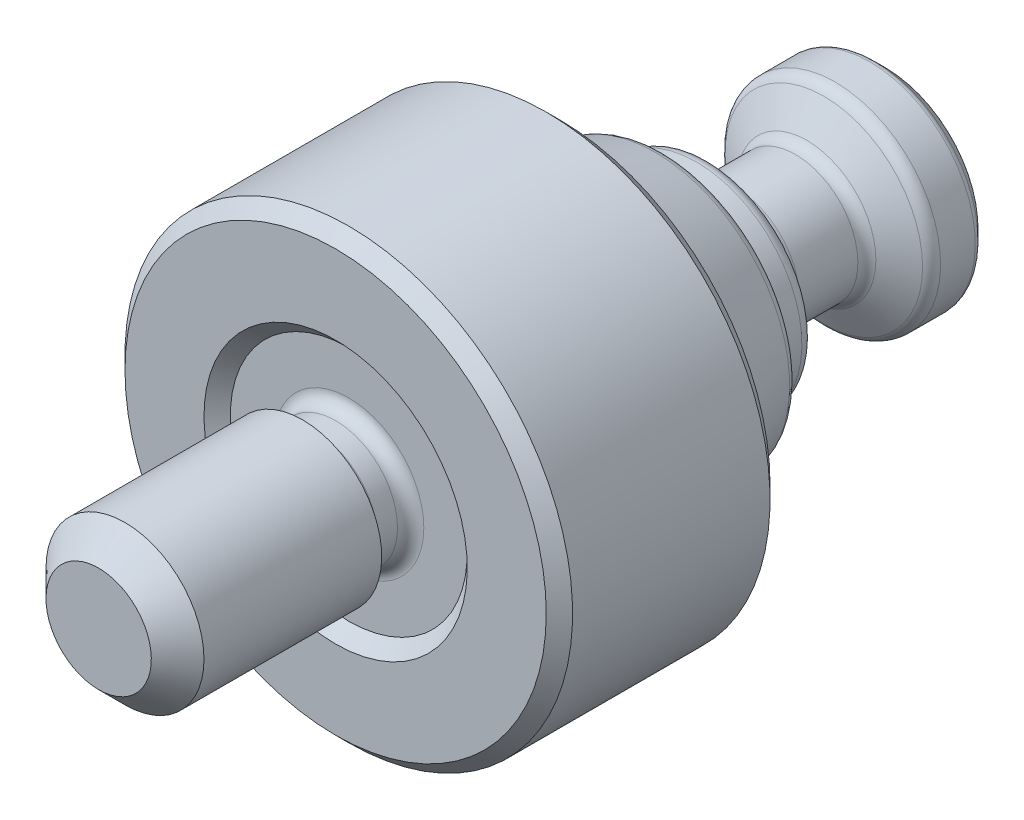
ISO-10303-21;
HEADER;
FILE_DESCRIPTION(('STEP AP214'),'2;1');
FILE_NAME('part.step','',(''),(''),'','','');
FILE_SCHEMA(('AUTOMOTIVE_DESIGN { 1 0 10303 214 1 1 1 1 }'));
ENDSEC;
DATA;
#1=APPLICATION_CONTEXT('core data for automotive mechanical design processes');
#2=APPLICATION_PROTOCOL_DEFINITION('international standard','automotive_design',2000,#1);
#3=PRODUCT_CONTEXT('',#1,'mechanical');
#4=PRODUCT('Part','Part','',(#3));
#5=PRODUCT_RELATED_PRODUCT_CATEGORY('part','',(#4));
#6=PRODUCT_DEFINITION_FORMATION('','',#4);
#7=PRODUCT_DEFINITION_CONTEXT('part definition',#1,'design');
#8=PRODUCT_DEFINITION('design','',#6,#7);
#9=PRODUCT_DEFINITION_SHAPE('','',#8);
#10=(LENGTH_UNIT() NAMED_UNIT(*) SI_UNIT(.MILLI.,.METRE.));
#11=(NAMED_UNIT(*) PLANE_ANGLE_UNIT() SI_UNIT($,.RADIAN.));
#12=(NAMED_UNIT(*) SI_UNIT($,.STERADIAN.) SOLID_ANGLE_UNIT());
#13=UNCERTAINTY_MEASURE_WITH_UNIT(LENGTH_MEASURE(1.E-05),#10,'distance_accuracy_value','');
#14=(GEOMETRIC_REPRESENTATION_CONTEXT(3) GLOBAL_UNCERTAINTY_ASSIGNED_CONTEXT((#13)) GLOBAL_UNIT_ASSIGNED_CONTEXT((#10,
#11,#12)) REPRESENTATION_CONTEXT('',''));
#15=CARTESIAN_POINT('',(0.,0.,0.));
#16=DIRECTION('',(0.,0.,1.));
#17=DIRECTION('',(1.,0.,0.));
#18=AXIS2_PLACEMENT_3D('',#15,#16,#17);
#19=CARTESIAN_POINT('',(0.,0.,16.));
#20=DIRECTION('',(0.,0.,-1.));
#21=DIRECTION('',(0.,1.,0.));
#22=AXIS2_PLACEMENT_3D('',#19,#20,#21);
#23=PLANE('',#22);
#24=CARTESIAN_POINT('',(0.,0.,16.));
#25=DIRECTION('',(0.,0.,1.));
#26=DIRECTION('',(1.,0.,0.));
#27=AXIS2_PLACEMENT_3D('',#24,#25,#26);
#28=CIRCLE('',#27,5.7);
#29=CARTESIAN_POINT('',(5.7,0.,16.));
#30=VERTEX_POINT('',#29);
#31=EDGE_CURVE('E23',#30,#30,#28,.T.);
#32=ORIENTED_EDGE('',*,*,#31,.F.);
#33=EDGE_LOOP('',(#32));
#34=FACE_BOUND('',#33,.T.);
#35=CARTESIAN_POINT('',(0.,0.,16.));
#36=DIRECTION('',(0.,0.,1.));
#37=DIRECTION('',(0.,-1.,0.));
#38=AXIS2_PLACEMENT_3D('',#35,#36,#37);
#39=CIRCLE('',#38,9.);
#40=CARTESIAN_POINT('',(0.,-9.,16.));
#41=VERTEX_POINT('',#40);
#42=EDGE_CURVE('E185',#41,#41,#39,.T.);
#43=ORIENTED_EDGE('',*,*,#42,.T.);
#44=EDGE_LOOP('',(#43));
#45=FACE_BOUND('',#44,.T.);
#46=ADVANCED_FACE('F14',(#34,#45),#23,.F.);
#47=CARTESIAN_POINT('',(0.,0.,35.));
#48=DIRECTION('',(0.,0.,1.));
#49=DIRECTION('',(0.,-1.,0.));
#50=AXIS2_PLACEMENT_3D('',#47,#48,#49);
#51=PLANE('',#50);
#52=CARTESIAN_POINT('',(0.,0.,35.));
#53=DIRECTION('',(0.,0.,1.));
#54=DIRECTION('',(0.,-1.,0.));
#55=AXIS2_PLACEMENT_3D('',#52,#53,#54);
#56=CIRCLE('',#55,4.);
#57=CARTESIAN_POINT('',(0.,-4.,35.));
#58=VERTEX_POINT('',#57);
#59=EDGE_CURVE('E125',#58,#58,#56,.T.);
#60=ORIENTED_EDGE('',*,*,#59,.T.);
#61=EDGE_LOOP('',(#60));
#62=FACE_BOUND('',#61,.T.);
#63=ADVANCED_FACE('F298',(#62),#51,.T.);
#64=CARTESIAN_POINT('',(0.,0.,33.));
#65=DIRECTION('',(0.,0.,-1.));
#66=DIRECTION('',(0.,1.,0.));
#67=AXIS2_PLACEMENT_3D('',#64,#65,#66);
#68=CONICAL_SURFACE('',#67,6.,0.785398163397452);
#69=ORIENTED_EDGE('',*,*,#59,.F.);
#70=EDGE_LOOP('',(#69));
#71=FACE_BOUND('',#70,.T.);
#72=CARTESIAN_POINT('',(0.,0.,33.));
#73=DIRECTION('',(0.,0.,1.));
#74=DIRECTION('',(0.,-1.,0.));
#75=AXIS2_PLACEMENT_3D('',#72,#73,#74);
#76=CIRCLE('',#75,6.);
#77=CARTESIAN_POINT('',(0.,-6.,33.));
#78=VERTEX_POINT('',#77);
#79=EDGE_CURVE('E122',#78,#78,#76,.F.);
#80=ORIENTED_EDGE('',*,*,#79,.F.);
#81=EDGE_LOOP('',(#80));
#82=FACE_BOUND('',#81,.T.);
#83=ADVANCED_FACE('F291',(#71,#82),#68,.T.);
#84=CARTESIAN_POINT('',(0.,0.,0.));
#85=DIRECTION('',(0.,0.,-1.));
#86=DIRECTION('',(0.,1.,0.));
#87=AXIS2_PLACEMENT_3D('',#84,#85,#86);
#88=CYLINDRICAL_SURFACE('',#87,6.);
#89=CARTESIAN_POINT('',(0.,0.,19.5));
#90=DIRECTION('',(0.,0.,-1.));
#91=DIRECTION('',(0.,1.,0.));
#92=AXIS2_PLACEMENT_3D('',#89,#90,#91);
#93=CIRCLE('',#92,6.);
#94=CARTESIAN_POINT('',(0.,6.,19.5));
#95=VERTEX_POINT('',#94);
#96=EDGE_CURVE('E193',#95,#95,#93,.T.);
#97=ORIENTED_EDGE('',*,*,#96,.F.);
#98=EDGE_LOOP('',(#97));
#99=FACE_BOUND('',#98,.T.);
#100=ORIENTED_EDGE('',*,*,#79,.T.);
#101=EDGE_LOOP('',(#100));
#102=FACE_BOUND('',#101,.T.);
#103=ADVANCED_FACE('F281',(#99,#102),#88,.T.);
#104=CARTESIAN_POINT('',(6.,0.,19.5));
#105=DIRECTION('',(0.,0.,1.));
#106=DIRECTION('',(0.,-1.,0.));
#107=AXIS2_PLACEMENT_3D('',#104,#105,#106);
#108=PLANE('',#107);
#109=CARTESIAN_POINT('',(0.,0.,19.5));
#110=DIRECTION('',(0.,0.,1.));
#111=DIRECTION('',(0.,-1.,0.));
#112=AXIS2_PLACEMENT_3D('',#109,#110,#111);
#113=CIRCLE('',#112,5.7);
#114=CARTESIAN_POINT('',(0.,-5.7,19.5));
#115=VERTEX_POINT('',#114);
#116=EDGE_CURVE('E18',#115,#115,#113,.T.);
#117=ORIENTED_EDGE('',*,*,#116,.T.);
#118=EDGE_LOOP('',(#117));
#119=FACE_BOUND('',#118,.T.);
#120=ORIENTED_EDGE('',*,*,#96,.T.);
#121=EDGE_LOOP('',(#120));
#122=FACE_BOUND('',#121,.T.);
#123=ADVANCED_FACE('F279',(#119,#122),#108,.F.);
#124=CARTESIAN_POINT('',(0.,0.,18.5));
#125=DIRECTION('',(0.,0.,1.));
#126=DIRECTION('',(0.,-1.,0.));
#127=AXIS2_PLACEMENT_3D('',#124,#125,#126);
#128=TOROIDAL_SURFACE('',#127,5.7,1.);
#129=ORIENTED_EDGE('',*,*,#116,.F.);
#130=EDGE_LOOP('',(#129));
#131=FACE_BOUND('',#130,.T.);
#132=CARTESIAN_POINT('',(0.,0.,18.5));
#133=DIRECTION('',(0.,0.,1.));
#134=DIRECTION('',(0.,-1.,0.));
#135=AXIS2_PLACEMENT_3D('',#132,#133,#134);
#136=CIRCLE('',#135,4.7);
#137=CARTESIAN_POINT('',(0.,-4.7,18.5));
#138=VERTEX_POINT('',#137);
#139=EDGE_CURVE('E161',#138,#138,#136,.F.);
#140=ORIENTED_EDGE('',*,*,#139,.F.);
#141=EDGE_LOOP('',(#140));
#142=FACE_BOUND('',#141,.T.);
#143=ADVANCED_FACE('F16',(#131,#142),#128,.F.);
#144=CARTESIAN_POINT('',(0.,0.,0.));
#145=DIRECTION('',(0.,0.,-1.));
#146=DIRECTION('',(0.,1.,0.));
#147=AXIS2_PLACEMENT_3D('',#144,#145,#146);
#148=CYLINDRICAL_SURFACE('',#147,4.7);
#149=CARTESIAN_POINT('',(0.,0.,17.));
#150=DIRECTION('',(0.,0.,1.));
#151=DIRECTION('',(0.,-1.,0.));
#152=AXIS2_PLACEMENT_3D('',#149,#150,#151);
#153=CIRCLE('',#152,4.7);
#154=CARTESIAN_POINT('',(0.,-4.7,17.));
#155=VERTEX_POINT('',#154);
#156=EDGE_CURVE('E163',#155,#155,#153,.T.);
#157=ORIENTED_EDGE('',*,*,#156,.T.);
#158=EDGE_LOOP('',(#157));
#159=FACE_BOUND('',#158,.T.);
#160=ORIENTED_EDGE('',*,*,#139,.T.);
#161=EDGE_LOOP('',(#160));
#162=FACE_BOUND('',#161,.T.);
#163=ADVANCED_FACE('F283',(#159,#162),#148,.T.);
#164=CARTESIAN_POINT('',(0.,0.,17.));
#165=DIRECTION('',(0.,0.,1.));
#166=DIRECTION('',(0.,-1.,0.));
#167=AXIS2_PLACEMENT_3D('',#164,#165,#166);
#168=TOROIDAL_SURFACE('',#167,5.7,1.);
#169=ORIENTED_EDGE('',*,*,#156,.F.);
#170=EDGE_LOOP('',(#169));
#171=FACE_BOUND('',#170,.T.);
#172=ORIENTED_EDGE('',*,*,#31,.T.);
#173=EDGE_LOOP('',(#172));
#174=FACE_BOUND('',#173,.T.);
#175=ADVANCED_FACE('F290',(#171,#174),#168,.F.);
#176=CARTESIAN_POINT('',(0.,0.,16.));
#177=DIRECTION('',(0.,0.,-1.));
#178=DIRECTION('',(0.,1.,0.));
#179=AXIS2_PLACEMENT_3D('',#176,#177,#178);
#180=CONICAL_SURFACE('',#179,17.,0.785398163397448);
#181=CARTESIAN_POINT('',(0.,0.,17.));
#182=DIRECTION('',(0.,0.,1.));
#183=DIRECTION('',(0.,-1.,0.));
#184=AXIS2_PLACEMENT_3D('',#181,#182,#183);
#185=CIRCLE('',#184,16.);
#186=CARTESIAN_POINT('',(0.,-16.,17.));
#187=VERTEX_POINT('',#186);
#188=EDGE_CURVE('E177',#187,#187,#185,.T.);
#189=ORIENTED_EDGE('',*,*,#188,.F.);
#190=EDGE_LOOP('',(#189));
#191=FACE_BOUND('',#190,.T.);
#192=CARTESIAN_POINT('',(0.,0.,16.));
#193=DIRECTION('',(0.,0.,1.));
#194=DIRECTION('',(0.,-1.,0.));
#195=AXIS2_PLACEMENT_3D('',#192,#193,#194);
#196=CIRCLE('',#195,17.);
#197=CARTESIAN_POINT('',(0.,-17.,16.));
#198=VERTEX_POINT('',#197);
#199=EDGE_CURVE('E172',#198,#198,#196,.F.);
#200=ORIENTED_EDGE('',*,*,#199,.F.);
#201=EDGE_LOOP('',(#200));
#202=FACE_BOUND('',#201,.T.);
#203=ADVANCED_FACE('F303',(#191,#202),#180,.T.);
#204=CARTESIAN_POINT('',(9.,0.,17.));
#205=DIRECTION('',(0.,0.,1.));
#206=DIRECTION('',(0.,-1.,0.));
#207=AXIS2_PLACEMENT_3D('',#204,#205,#206);
#208=PLANE('',#207);
#209=CARTESIAN_POINT('',(0.,0.,17.));
#210=DIRECTION('',(0.,0.,1.));
#211=DIRECTION('',(0.,-1.,0.));
#212=AXIS2_PLACEMENT_3D('',#209,#210,#211);
#213=CIRCLE('',#212,10.);
#214=CARTESIAN_POINT('',(0.,-10.,17.));
#215=VERTEX_POINT('',#214);
#216=EDGE_CURVE('E188',#215,#215,#213,.F.);
#217=ORIENTED_EDGE('',*,*,#216,.T.);
#218=EDGE_LOOP('',(#217));
#219=FACE_BOUND('',#218,.T.);
#220=ORIENTED_EDGE('',*,*,#188,.T.);
#221=EDGE_LOOP('',(#220));
#222=FACE_BOUND('',#221,.T.);
#223=ADVANCED_FACE('F387',(#219,#222),#208,.T.);
#224=CARTESIAN_POINT('',(0.,0.,17.));
#225=DIRECTION('',(0.,0.,1.));
#226=DIRECTION('',(0.,-1.,0.));
#227=AXIS2_PLACEMENT_3D('',#224,#225,#226);
#228=CONICAL_SURFACE('',#227,10.,0.785398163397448);
#229=ORIENTED_EDGE('',*,*,#42,.F.);
#230=EDGE_LOOP('',(#229));
#231=FACE_BOUND('',#230,.T.);
#232=ORIENTED_EDGE('',*,*,#216,.F.);
#233=EDGE_LOOP('',(#232));
#234=FACE_BOUND('',#233,.T.);
#235=ADVANCED_FACE('F391',(#231,#234),#228,.F.);
#236=CARTESIAN_POINT('',(0.,0.,0.));
#237=DIRECTION('',(0.,0.,-1.));
#238=DIRECTION('',(0.,1.,0.));
#239=AXIS2_PLACEMENT_3D('',#236,#237,#238);
#240=CYLINDRICAL_SURFACE('',#239,17.);
#241=ORIENTED_EDGE('',*,*,#199,.T.);
#242=EDGE_LOOP('',(#241));
#243=FACE_BOUND('',#242,.T.);
#244=CARTESIAN_POINT('',(0.,0.,1.));
#245=DIRECTION('',(0.,0.,-1.));
#246=DIRECTION('',(0.,1.,0.));
#247=AXIS2_PLACEMENT_3D('',#244,#245,#246);
#248=CIRCLE('',#247,17.);
#249=CARTESIAN_POINT('',(0.,17.,1.));
#250=VERTEX_POINT('',#249);
#251=EDGE_CURVE('E168',#250,#250,#248,.F.);
#252=ORIENTED_EDGE('',*,*,#251,.T.);
#253=EDGE_LOOP('',(#252));
#254=FACE_BOUND('',#253,.T.);
#255=ADVANCED_FACE('F381',(#243,#254),#240,.T.);
#256=CARTESIAN_POINT('',(0.,0.,0.));
#257=DIRECTION('',(0.,0.,1.));
#258=DIRECTION('',(0.,-1.,0.));
#259=AXIS2_PLACEMENT_3D('',#256,#257,#258);
#260=CONICAL_SURFACE('',#259,16.,0.78539816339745);
#261=ORIENTED_EDGE('',*,*,#251,.F.);
#262=EDGE_LOOP('',(#261));
#263=FACE_BOUND('',#262,.T.);
#264=CARTESIAN_POINT('',(0.,0.,0.));
#265=DIRECTION('',(0.,0.,-1.));
#266=DIRECTION('',(0.,1.,0.));
#267=AXIS2_PLACEMENT_3D('',#264,#265,#266);
#268=CIRCLE('',#267,16.);
#269=CARTESIAN_POINT('',(0.,16.,0.));
#270=VERTEX_POINT('',#269);
#271=EDGE_CURVE('E182',#270,#270,#268,.T.);
#272=ORIENTED_EDGE('',*,*,#271,.F.);
#273=EDGE_LOOP('',(#272));
#274=FACE_BOUND('',#273,.T.);
#275=ADVANCED_FACE('F373',(#263,#274),#260,.T.);
#276=CARTESIAN_POINT('',(17.,0.,0.));
#277=DIRECTION('',(0.,0.,-1.));
#278=DIRECTION('',(0.,1.,0.));
#279=AXIS2_PLACEMENT_3D('',#276,#277,#278);
#280=PLANE('',#279);
#281=ORIENTED_EDGE('',*,*,#271,.T.);
#282=EDGE_LOOP('',(#281));
#283=FACE_BOUND('',#282,.T.);
#284=CARTESIAN_POINT('',(0.,0.,0.));
#285=DIRECTION('',(0.,0.,-1.));
#286=DIRECTION('',(-1.,0.,0.));
#287=AXIS2_PLACEMENT_3D('',#284,#285,#286);
#288=CIRCLE('',#287,11.8);
#289=CARTESIAN_POINT('',(-11.8,0.,0.));
#290=VERTEX_POINT('',#289);
#291=EDGE_CURVE('E9',#290,#290,#288,.T.);
#292=ORIENTED_EDGE('',*,*,#291,.F.);
#293=EDGE_LOOP('',(#292));
#294=FACE_BOUND('',#293,.T.);
#295=ADVANCED_FACE('F362',(#283,#294),#280,.T.);
#296=CARTESIAN_POINT('',(2.88675134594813,0.,-21.5));
#297=DIRECTION('',(0.,0.,-1.));
#298=DIRECTION('',(0.,1.,0.));
#299=AXIS2_PLACEMENT_3D('',#296,#297,#298);
#300=PLANE('',#299);
#301=DIRECTION('',(-0.5,0.866025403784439,0.));
#302=VECTOR('',#301,1.);
#303=CARTESIAN_POINT('',(-1.44337567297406,-2.5,-21.5));
#304=LINE('',#303,#302);
#305=CARTESIAN_POINT('',(-1.44337567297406,-2.5,-21.5));
#306=VERTEX_POINT('',#305);
#307=CARTESIAN_POINT('',(-2.88675134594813,0.,-21.5));
#308=VERTEX_POINT('',#307);
#309=EDGE_CURVE('E700',#306,#308,#304,.T.);
#310=ORIENTED_EDGE('',*,*,#309,.T.);
#311=DIRECTION('',(0.5,0.866025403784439,0.));
#312=VECTOR('',#311,1.);
#313=CARTESIAN_POINT('',(-2.88675134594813,0.,-21.5));
#314=LINE('',#313,#312);
#315=CARTESIAN_POINT('',(-1.44337567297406,2.5,-21.5));
#316=VERTEX_POINT('',#315);
#317=EDGE_CURVE('E701',#308,#316,#314,.T.);
#318=ORIENTED_EDGE('',*,*,#317,.T.);
#319=DIRECTION('',(1.,0.,0.));
#320=VECTOR('',#319,1.);
#321=CARTESIAN_POINT('',(-1.44337567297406,2.5,-21.5));
#322=LINE('',#321,#320);
#323=CARTESIAN_POINT('',(1.44337567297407,2.5,-21.5));
#324=VERTEX_POINT('',#323);
#325=EDGE_CURVE('E39',#316,#324,#322,.T.);
#326=ORIENTED_EDGE('',*,*,#325,.T.);
#327=DIRECTION('',(0.5,-0.866025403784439,0.));
#328=VECTOR('',#327,1.);
#329=CARTESIAN_POINT('',(1.44337567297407,2.5,-21.5));
#330=LINE('',#329,#328);
#331=CARTESIAN_POINT('',(2.88675134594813,0.,-21.5));
#332=VERTEX_POINT('',#331);
#333=EDGE_CURVE('E87',#324,#332,#330,.T.);
#334=ORIENTED_EDGE('',*,*,#333,.T.);
#335=DIRECTION('',(-0.5,-0.866025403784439,0.));
#336=VECTOR('',#335,1.);
#337=CARTESIAN_POINT('',(2.88675134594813,0.,-21.5));
#338=LINE('',#337,#336);
#339=CARTESIAN_POINT('',(1.44337567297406,-2.5,-21.5));
#340=VERTEX_POINT('',#339);
#341=EDGE_CURVE('E704',#332,#340,#338,.T.);
#342=ORIENTED_EDGE('',*,*,#341,.T.);
#343=DIRECTION('',(-1.,0.,0.));
#344=VECTOR('',#343,1.);
#345=CARTESIAN_POINT('',(1.44337567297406,-2.5,-21.5));
#346=LINE('',#345,#344);
#347=EDGE_CURVE('E702',#340,#306,#346,.T.);
#348=ORIENTED_EDGE('',*,*,#347,.T.);
#349=EDGE_LOOP('',(#310,#318,#326,#334,#342,#348));
#350=FACE_BOUND('',#349,.T.);
#351=ADVANCED_FACE('F261',(#350),#300,.T.);
#352=CARTESIAN_POINT('',(1.44337567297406,-2.5,-21.5));
#353=DIRECTION('',(0.,-1.,0.));
#354=DIRECTION('',(1.,0.,0.));
#355=AXIS2_PLACEMENT_3D('',#352,#353,#354);
#356=PLANE('',#355);
#357=CARTESIAN_POINT('',(-3.77372348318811,-2.5,-25.7659690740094));
#358=CARTESIAN_POINT('',(-3.66532713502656,-2.5,-25.7138116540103));
#359=CARTESIAN_POINT('',(-3.5566704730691,-2.5,-25.6621853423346));
#360=CARTESIAN_POINT('',(-3.33869759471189,-2.5,-25.5602960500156));
#361=CARTESIAN_POINT('',(-3.22938126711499,-2.5,-25.5100333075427));
#362=CARTESIAN_POINT('',(-3.00933576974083,-2.5,-25.4108968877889));
#363=CARTESIAN_POINT('',(-2.89860206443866,-2.5,-25.3620332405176));
#364=CARTESIAN_POINT('',(-2.67621651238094,-2.5,-25.2664499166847));
#365=CARTESIAN_POINT('',(-2.56456471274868,-2.5,-25.2197301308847));
#366=CARTESIAN_POINT('',(-2.33704252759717,-2.5,-25.1277417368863));
#367=CARTESIAN_POINT('',(-2.22114109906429,-2.5,-25.082549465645));
#368=CARTESIAN_POINT('',(-1.98794483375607,-2.5,-24.9958424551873));
#369=CARTESIAN_POINT('',(-1.87064983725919,-2.5,-24.9543281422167));
#370=CARTESIAN_POINT('',(-1.63473483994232,-2.5,-24.8761429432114));
#371=CARTESIAN_POINT('',(-1.51611844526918,-2.5,-24.8394612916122));
#372=CARTESIAN_POINT('',(-1.27718906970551,-2.5,-24.7721855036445));
#373=CARTESIAN_POINT('',(-1.15687666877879,-2.5,-24.7415893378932));
#374=CARTESIAN_POINT('',(-0.91510414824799,-2.5,-24.6881678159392));
#375=CARTESIAN_POINT('',(-0.793652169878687,-2.5,-24.6653063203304));
#376=CARTESIAN_POINT('',(-0.549353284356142,-2.5,-24.628724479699));
#377=CARTESIAN_POINT('',(-0.426506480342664,-2.5,-24.6150034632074));
#378=CARTESIAN_POINT('',(-0.181589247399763,-2.5,-24.5979769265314));
#379=CARTESIAN_POINT('',(-0.0595277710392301,-2.5,-24.5945457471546));
#380=CARTESIAN_POINT('',(0.184453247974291,-2.5,-24.5980647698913));
#381=CARTESIAN_POINT('',(0.306372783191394,-2.5,-24.6050154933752));
#382=CARTESIAN_POINT('',(0.516525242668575,-2.5,-24.6254710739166));
#383=CARTESIAN_POINT('',(0.604990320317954,-2.5,-24.636707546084));
#384=CARTESIAN_POINT('',(0.78120116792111,-2.5,-24.6638879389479));
#385=CARTESIAN_POINT('',(0.868946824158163,-2.5,-24.6798325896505));
#386=CARTESIAN_POINT('',(1.13101461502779,-2.5,-24.73388535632));
#387=CARTESIAN_POINT('',(1.30405772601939,-2.5,-24.7782002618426));
#388=CARTESIAN_POINT('',(1.65032858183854,-2.5,-24.879785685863));
#389=CARTESIAN_POINT('',(1.82347546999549,-2.5,-24.9373214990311));
#390=CARTESIAN_POINT('',(2.08081862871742,-2.5,-25.0300094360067));
#391=CARTESIAN_POINT('',(2.16619199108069,-2.5,-25.0619646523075));
#392=CARTESIAN_POINT('',(2.33624768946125,-2.5,-25.1276627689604));
#393=CARTESIAN_POINT('',(2.42093003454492,-2.5,-25.1614056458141));
#394=CARTESIAN_POINT('',(2.62603474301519,-2.5,-25.2452265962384));
#395=CARTESIAN_POINT('',(2.7461393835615,-2.5,-25.2960801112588));
#396=CARTESIAN_POINT('',(2.9853252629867,-2.5,-25.4001455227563));
#397=CARTESIAN_POINT('',(3.10440644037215,-2.5,-25.4533575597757));
#398=CARTESIAN_POINT('',(3.46043992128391,-2.5,-25.6157641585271));
#399=CARTESIAN_POINT('',(3.69613537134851,-2.5,-25.7277095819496));
#400=CARTESIAN_POINT('',(4.16548797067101,-2.5,-25.9563787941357));
#401=CARTESIAN_POINT('',(4.39914263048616,-2.5,-26.0731076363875));
#402=CARTESIAN_POINT('',(4.86481739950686,-2.5,-26.3097054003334));
#403=CARTESIAN_POINT('',(5.09683770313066,-2.5,-26.4295739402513));
#404=CARTESIAN_POINT('',(5.5396497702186,-2.5,-26.6610256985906));
#405=CARTESIAN_POINT('',(5.75053751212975,-2.5,-26.7724259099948));
#406=CARTESIAN_POINT('',(6.17158854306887,-2.5,-26.9966038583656));
#407=CARTESIAN_POINT('',(6.38175180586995,-2.5,-27.109381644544));
#408=CARTESIAN_POINT('',(6.80101584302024,-2.5,-27.3357110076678));
#409=CARTESIAN_POINT('',(7.01011795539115,-2.5,-27.4492601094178));
#410=CARTESIAN_POINT('',(7.42786313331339,-2.5,-27.6771738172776));
#411=CARTESIAN_POINT('',(7.63650622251,-2.5,-27.7915383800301));
#412=CARTESIAN_POINT('',(7.84498187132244,-2.5,-27.9062054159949));
#413=B_SPLINE_CURVE_WITH_KNOTS('',3,(#357,#358,#359,#360,#361,#362,#363,#364,#365,#366,#367,
#368,#369,#370,#371,#372,#373,#374,#375,#376,#377,#378,#379,#380,#381,#382,#383,#384,#385,#386,
#387,#388,#389,#390,#391,#392,#393,#394,#395,#396,#397,#398,#399,#400,#401,#402,#403,#404,#405,
#406,#407,#408,#409,#410,#411,#412),.UNSPECIFIED.,.F.,.F.,(4,2,2,2,2,2,2,2,2,2,2,2,2,2,2,2,2,2,
2,2,2,2,2,2,2,2,2,4),(0.,0.360880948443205,0.721824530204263,1.08491311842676,1.44798318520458,
1.8211364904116,2.19433298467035,2.56668353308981,2.93890970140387,3.30937185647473,
3.6798067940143,4.04569918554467,4.41160995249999,4.67900678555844,4.94644510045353,
5.48165172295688,6.02871656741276,6.30217432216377,6.57562848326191,6.96687524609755,
7.35814535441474,8.14083774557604,8.92437948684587,9.70782639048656,10.4233292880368,
11.1388578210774,11.8526862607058,12.5664770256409),.UNSPECIFIED.);
#414=CARTESIAN_POINT('',(-1.44337567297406,-2.5,-24.8191458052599));
#415=VERTEX_POINT('',#414);
#416=CARTESIAN_POINT('',(1.44337567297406,-2.5,-24.8191458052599));
#417=VERTEX_POINT('',#416);
#418=EDGE_CURVE('E246',#415,#417,#413,.T.);
#419=ORIENTED_EDGE('',*,*,#418,.F.);
#420=DIRECTION('',(0.,0.,-1.));
#421=VECTOR('',#420,1.);
#422=CARTESIAN_POINT('',(-1.44337567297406,-2.5,-21.5));
#423=LINE('',#422,#421);
#424=EDGE_CURVE('E100',#306,#415,#423,.T.);
#425=ORIENTED_EDGE('',*,*,#424,.F.);
#426=ORIENTED_EDGE('',*,*,#347,.F.);
#427=DIRECTION('',(0.,0.,-1.));
#428=VECTOR('',#427,1.);
#429=CARTESIAN_POINT('',(1.44337567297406,-2.5,-21.5));
#430=LINE('',#429,#428);
#431=EDGE_CURVE('E103',#340,#417,#430,.T.);
#432=ORIENTED_EDGE('',*,*,#431,.T.);
#433=EDGE_LOOP('',(#419,#425,#426,#432));
#434=FACE_BOUND('',#433,.T.);
#435=ADVANCED_FACE('F257',(#434),#356,.F.);
#436=CARTESIAN_POINT('',(-1.44337567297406,-2.5,-21.5));
#437=DIRECTION('',(-0.866025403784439,-0.5,0.));
#438=DIRECTION('',(0.5,-0.866025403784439,0.));
#439=AXIS2_PLACEMENT_3D('',#436,#437,#438);
#440=PLANE('',#439);
#441=CARTESIAN_POINT('',(-2.88686681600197,0.00019999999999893,-24.8192124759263));
#442=CARTESIAN_POINT('',(-2.82343724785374,-0.109663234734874,-24.7825764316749));
#443=CARTESIAN_POINT('',(-2.75946016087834,-0.220474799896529,-24.7492570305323));
#444=CARTESIAN_POINT('',(-2.63039810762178,-0.444016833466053,-24.6910970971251));
#445=CARTESIAN_POINT('',(-2.56531084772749,-0.556751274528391,-24.666277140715));
#446=CARTESIAN_POINT('',(-2.43594298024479,-0.780822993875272,-24.6276404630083));
#447=CARTESIAN_POINT('',(-2.37168227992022,-0.89212579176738,-24.6135666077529));
#448=CARTESIAN_POINT('',(-2.24285844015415,-1.11525522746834,-24.59676396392));
#449=CARTESIAN_POINT('',(-2.17829576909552,-1.22708105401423,-24.5940212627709));
#450=CARTESIAN_POINT('',(-2.05765212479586,-1.43604197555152,-24.5997205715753));
#451=CARTESIAN_POINT('',(-2.0015531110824,-1.53320831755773,-24.6067632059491));
#452=CARTESIAN_POINT('',(-1.88972057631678,-1.726907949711,-24.6290862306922));
#453=CARTESIAN_POINT('',(-1.8339874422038,-1.82344056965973,-24.6443742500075));
#454=CARTESIAN_POINT('',(-1.7219242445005,-2.01753972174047,-24.6825939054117));
#455=CARTESIAN_POINT('',(-1.66560836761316,-2.11508168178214,-24.7056875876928));
#456=CARTESIAN_POINT('',(-1.55381665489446,-2.30871060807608,-24.7581014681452));
#457=CARTESIAN_POINT('',(-1.49833938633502,-2.40480005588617,-24.7874093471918));
#458=CARTESIAN_POINT('',(-1.44326020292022,-2.5002,-24.8192124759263));
#459=B_SPLINE_CURVE_WITH_KNOTS('',3,(#441,#442,#443,#444,#445,#446,#447,#448,#449,#450,#451,
#452,#453,#454,#455,#456,#457,#458),.UNSPECIFIED.,.F.,.F.,(4,2,2,2,2,2,2,2,4),(0.,
0.396285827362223,0.793524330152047,1.18093086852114,1.56786160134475,1.90479741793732,
2.24204551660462,2.58677531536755,2.93082800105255),.UNSPECIFIED.);
#460=CARTESIAN_POINT('',(-2.88675134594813,0.,-24.8191458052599));
#461=VERTEX_POINT('',#460);
#462=EDGE_CURVE('E239',#461,#415,#459,.T.);
#463=ORIENTED_EDGE('',*,*,#462,.F.);
#464=DIRECTION('',(0.,0.,-1.));
#465=VECTOR('',#464,1.);
#466=CARTESIAN_POINT('',(-2.88675134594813,0.,-21.5));
#467=LINE('',#466,#465);
#468=EDGE_CURVE('E93',#308,#461,#467,.T.);
#469=ORIENTED_EDGE('',*,*,#468,.F.);
#470=ORIENTED_EDGE('',*,*,#309,.F.);
#471=ORIENTED_EDGE('',*,*,#424,.T.);
#472=EDGE_LOOP('',(#463,#469,#470,#471));
#473=FACE_BOUND('',#472,.T.);
#474=ADVANCED_FACE('F260',(#473),#440,.F.);
#475=CARTESIAN_POINT('',(-2.88675134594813,0.,-21.5));
#476=DIRECTION('',(-0.866025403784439,0.5,0.));
#477=DIRECTION('',(-0.5,-0.866025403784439,0.));
#478=AXIS2_PLACEMENT_3D('',#475,#476,#477);
#479=PLANE('',#478);
#480=CARTESIAN_POINT('',(-1.44326020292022,2.5002,-24.8192124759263));
#481=CARTESIAN_POINT('',(-1.50668977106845,2.39033676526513,-24.7825764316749));
#482=CARTESIAN_POINT('',(-1.57066685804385,2.27952520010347,-24.7492570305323));
#483=CARTESIAN_POINT('',(-1.69972891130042,2.05598316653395,-24.6910970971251));
#484=CARTESIAN_POINT('',(-1.7648161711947,1.94324872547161,-24.666277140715));
#485=CARTESIAN_POINT('',(-1.8941840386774,1.71917700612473,-24.6276404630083));
#486=CARTESIAN_POINT('',(-1.95844473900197,1.60787420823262,-24.6135666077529));
#487=CARTESIAN_POINT('',(-2.08726857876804,1.38474477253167,-24.59676396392));
#488=CARTESIAN_POINT('',(-2.15183124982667,1.27291894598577,-24.5940212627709));
#489=CARTESIAN_POINT('',(-2.27247489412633,1.06395802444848,-24.5997205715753));
#490=CARTESIAN_POINT('',(-2.32857390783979,0.966791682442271,-24.6067632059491));
#491=CARTESIAN_POINT('',(-2.44040644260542,0.773092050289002,-24.6290862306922));
#492=CARTESIAN_POINT('',(-2.49613957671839,0.676559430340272,-24.6443742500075));
#493=CARTESIAN_POINT('',(-2.60820277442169,0.482460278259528,-24.6825939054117));
#494=CARTESIAN_POINT('',(-2.66451865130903,0.384918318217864,-24.7056875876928));
#495=CARTESIAN_POINT('',(-2.77631036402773,0.191289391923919,-24.7581014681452));
#496=CARTESIAN_POINT('',(-2.83178763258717,0.0951999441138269,-24.7874093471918));
#497=CARTESIAN_POINT('',(-2.88686681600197,-0.000200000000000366,-24.8192124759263));
#498=B_SPLINE_CURVE_WITH_KNOTS('',3,(#480,#481,#482,#483,#484,#485,#486,#487,#488,#489,#490,
#491,#492,#493,#494,#495,#496,#497),.UNSPECIFIED.,.F.,.F.,(4,2,2,2,2,2,2,2,4),(0.,
0.396285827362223,0.793524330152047,1.18093086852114,1.56786160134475,1.90479741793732,
2.24204551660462,2.58677531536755,2.93082800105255),.UNSPECIFIED.);
#499=CARTESIAN_POINT('',(-1.44337567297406,2.5,-24.8191458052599));
#500=VERTEX_POINT('',#499);
#501=EDGE_CURVE('E84',#500,#461,#498,.T.);
#502=ORIENTED_EDGE('',*,*,#501,.F.);
#503=DIRECTION('',(0.,0.,-1.));
#504=VECTOR('',#503,1.);
#505=CARTESIAN_POINT('',(-1.44337567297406,2.5,-21.5));
#506=LINE('',#505,#504);
#507=EDGE_CURVE('E83',#316,#500,#506,.T.);
#508=ORIENTED_EDGE('',*,*,#507,.F.);
#509=ORIENTED_EDGE('',*,*,#317,.F.);
#510=ORIENTED_EDGE('',*,*,#468,.T.);
#511=EDGE_LOOP('',(#502,#508,#509,#510));
#512=FACE_BOUND('',#511,.T.);
#513=ADVANCED_FACE('F571',(#512),#479,.F.);
#514=CARTESIAN_POINT('',(-1.44337567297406,2.5,-21.5));
#515=DIRECTION('',(0.,1.,0.));
#516=DIRECTION('',(-1.,0.,0.));
#517=AXIS2_PLACEMENT_3D('',#514,#515,#516);
#518=PLANE('',#517);
#519=CARTESIAN_POINT('',(-3.77372348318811,2.5,-25.7659690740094));
#520=CARTESIAN_POINT('',(-3.66532713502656,2.5,-25.7138116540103));
#521=CARTESIAN_POINT('',(-3.5566704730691,2.5,-25.6621853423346));
#522=CARTESIAN_POINT('',(-3.33869759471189,2.5,-25.5602960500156));
#523=CARTESIAN_POINT('',(-3.22938126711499,2.5,-25.5100333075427));
#524=CARTESIAN_POINT('',(-3.00933576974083,2.5,-25.4108968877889));
#525=CARTESIAN_POINT('',(-2.89860206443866,2.5,-25.3620332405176));
#526=CARTESIAN_POINT('',(-2.67621651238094,2.5,-25.2664499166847));
#527=CARTESIAN_POINT('',(-2.56456471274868,2.5,-25.2197301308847));
#528=CARTESIAN_POINT('',(-2.33704252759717,2.5,-25.1277417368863));
#529=CARTESIAN_POINT('',(-2.22114109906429,2.5,-25.082549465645));
#530=CARTESIAN_POINT('',(-1.98794483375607,2.5,-24.9958424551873));
#531=CARTESIAN_POINT('',(-1.87064983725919,2.5,-24.9543281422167));
#532=CARTESIAN_POINT('',(-1.63473483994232,2.5,-24.8761429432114));
#533=CARTESIAN_POINT('',(-1.51611844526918,2.5,-24.8394612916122));
#534=CARTESIAN_POINT('',(-1.27718906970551,2.5,-24.7721855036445));
#535=CARTESIAN_POINT('',(-1.15687666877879,2.5,-24.7415893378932));
#536=CARTESIAN_POINT('',(-0.915104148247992,2.5,-24.6881678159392));
#537=CARTESIAN_POINT('',(-0.793652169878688,2.5,-24.6653063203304));
#538=CARTESIAN_POINT('',(-0.549353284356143,2.5,-24.628724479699));
#539=CARTESIAN_POINT('',(-0.426506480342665,2.5,-24.6150034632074));
#540=CARTESIAN_POINT('',(-0.181589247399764,2.5,-24.5979769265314));
#541=CARTESIAN_POINT('',(-0.0595277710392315,2.5,-24.5945457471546));
#542=CARTESIAN_POINT('',(0.18445324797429,2.5,-24.5980647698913));
#543=CARTESIAN_POINT('',(0.306372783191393,2.5,-24.6050154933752));
#544=CARTESIAN_POINT('',(0.516525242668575,2.5,-24.6254710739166));
#545=CARTESIAN_POINT('',(0.604990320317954,2.5,-24.636707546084));
#546=CARTESIAN_POINT('',(0.781201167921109,2.5,-24.6638879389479));
#547=CARTESIAN_POINT('',(0.868946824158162,2.5,-24.6798325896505));
#548=CARTESIAN_POINT('',(1.13101461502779,2.5,-24.73388535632));
#549=CARTESIAN_POINT('',(1.30405772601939,2.5,-24.7782002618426));
#550=CARTESIAN_POINT('',(1.65032858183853,2.5,-24.879785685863));
#551=CARTESIAN_POINT('',(1.82347546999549,2.5,-24.9373214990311));
#552=CARTESIAN_POINT('',(2.08081862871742,2.5,-25.0300094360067));
#553=CARTESIAN_POINT('',(2.16619199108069,2.5,-25.0619646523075));
#554=CARTESIAN_POINT('',(2.33624768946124,2.5,-25.1276627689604));
#555=CARTESIAN_POINT('',(2.42093003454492,2.5,-25.1614056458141));
#556=CARTESIAN_POINT('',(2.62603474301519,2.5,-25.2452265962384));
#557=CARTESIAN_POINT('',(2.74613938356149,2.5,-25.2960801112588));
#558=CARTESIAN_POINT('',(2.9853252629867,2.5,-25.4001455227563));
#559=CARTESIAN_POINT('',(3.10440644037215,2.5,-25.4533575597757));
#560=CARTESIAN_POINT('',(3.46043992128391,2.5,-25.6157641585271));
#561=CARTESIAN_POINT('',(3.69613537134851,2.5,-25.7277095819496));
#562=CARTESIAN_POINT('',(4.16548797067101,2.5,-25.9563787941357));
#563=CARTESIAN_POINT('',(4.39914263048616,2.5,-26.0731076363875));
#564=CARTESIAN_POINT('',(4.86481739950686,2.5,-26.3097054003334));
#565=CARTESIAN_POINT('',(5.09683770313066,2.5,-26.4295739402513));
#566=CARTESIAN_POINT('',(5.5396497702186,2.5,-26.6610256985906));
#567=CARTESIAN_POINT('',(5.75053751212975,2.5,-26.7724259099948));
#568=CARTESIAN_POINT('',(6.17158854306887,2.5,-26.9966038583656));
#569=CARTESIAN_POINT('',(6.38175180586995,2.5,-27.109381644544));
#570=CARTESIAN_POINT('',(6.80101584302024,2.5,-27.3357110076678));
#571=CARTESIAN_POINT('',(7.01011795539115,2.5,-27.4492601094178));
#572=CARTESIAN_POINT('',(7.42786313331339,2.5,-27.6771738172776));
#573=CARTESIAN_POINT('',(7.63650622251,2.5,-27.7915383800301));
#574=CARTESIAN_POINT('',(7.84498187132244,2.5,-27.9062054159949));
#575=B_SPLINE_CURVE_WITH_KNOTS('',3,(#519,#520,#521,#522,#523,#524,#525,#526,#527,#528,#529,
#530,#531,#532,#533,#534,#535,#536,#537,#538,#539,#540,#541,#542,#543,#544,#545,#546,#547,#548,
#549,#550,#551,#552,#553,#554,#555,#556,#557,#558,#559,#560,#561,#562,#563,#564,#565,#566,#567,
#568,#569,#570,#571,#572,#573,#574),.UNSPECIFIED.,.F.,.F.,(4,2,2,2,2,2,2,2,2,2,2,2,2,2,2,2,2,2,
2,2,2,2,2,2,2,2,2,4),(0.,0.360880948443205,0.721824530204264,1.08491311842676,1.44798318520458,
1.8211364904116,2.19433298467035,2.56668353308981,2.93890970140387,3.30937185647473,
3.6798067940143,4.04569918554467,4.41160995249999,4.67900678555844,4.94644510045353,
5.48165172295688,6.02871656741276,6.30217432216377,6.57562848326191,6.96687524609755,
7.35814535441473,8.14083774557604,8.92437948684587,9.70782639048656,10.4233292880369,
11.1388578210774,11.8526862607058,12.5664770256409),.UNSPECIFIED.);
#576=CARTESIAN_POINT('',(1.44337567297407,2.5,-24.8191458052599));
#577=VERTEX_POINT('',#576);
#578=EDGE_CURVE('E69',#577,#500,#575,.F.);
#579=ORIENTED_EDGE('',*,*,#578,.F.);
#580=DIRECTION('',(0.,0.,-1.));
#581=VECTOR('',#580,1.);
#582=CARTESIAN_POINT('',(1.44337567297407,2.5,-21.5));
#583=LINE('',#582,#581);
#584=EDGE_CURVE('E80',#324,#577,#583,.T.);
#585=ORIENTED_EDGE('',*,*,#584,.F.);
#586=ORIENTED_EDGE('',*,*,#325,.F.);
#587=ORIENTED_EDGE('',*,*,#507,.T.);
#588=EDGE_LOOP('',(#579,#585,#586,#587));
#589=FACE_BOUND('',#588,.T.);
#590=ADVANCED_FACE('F79',(#589),#518,.F.);
#591=CARTESIAN_POINT('',(1.44337567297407,2.5,-21.5));
#592=DIRECTION('',(0.866025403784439,0.5,0.));
#593=DIRECTION('',(-0.5,0.866025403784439,0.));
#594=AXIS2_PLACEMENT_3D('',#591,#592,#593);
#595=PLANE('',#594);
#596=CARTESIAN_POINT('',(2.88686681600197,-0.000199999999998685,-24.8192124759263));
#597=CARTESIAN_POINT('',(2.82343724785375,0.109663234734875,-24.7825764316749));
#598=CARTESIAN_POINT('',(2.75946016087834,0.220474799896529,-24.7492570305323));
#599=CARTESIAN_POINT('',(2.63039810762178,0.444016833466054,-24.6910970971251));
#600=CARTESIAN_POINT('',(2.5653108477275,0.556751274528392,-24.666277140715));
#601=CARTESIAN_POINT('',(2.43594298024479,0.780822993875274,-24.6276404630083));
#602=CARTESIAN_POINT('',(2.37168227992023,0.892125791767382,-24.6135666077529));
#603=CARTESIAN_POINT('',(2.24285844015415,1.11525522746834,-24.59676396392));
#604=CARTESIAN_POINT('',(2.17829576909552,1.22708105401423,-24.5940212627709));
#605=CARTESIAN_POINT('',(2.05765212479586,1.43604197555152,-24.5997205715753));
#606=CARTESIAN_POINT('',(2.0015531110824,1.53320831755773,-24.6067632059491));
#607=CARTESIAN_POINT('',(1.88972057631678,1.726907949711,-24.6290862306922));
#608=CARTESIAN_POINT('',(1.8339874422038,1.82344056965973,-24.6443742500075));
#609=CARTESIAN_POINT('',(1.72192424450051,2.01753972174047,-24.6825939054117));
#610=CARTESIAN_POINT('',(1.66560836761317,2.11508168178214,-24.7056875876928));
#611=CARTESIAN_POINT('',(1.55381665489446,2.30871060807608,-24.7581014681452));
#612=CARTESIAN_POINT('',(1.49833938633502,2.40480005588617,-24.7874093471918));
#613=CARTESIAN_POINT('',(1.44326020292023,2.5002,-24.8192124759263));
#614=B_SPLINE_CURVE_WITH_KNOTS('',3,(#596,#597,#598,#599,#600,#601,#602,#603,#604,#605,#606,
#607,#608,#609,#610,#611,#612,#613),.UNSPECIFIED.,.F.,.F.,(4,2,2,2,2,2,2,2,4),(0.,
0.396285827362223,0.793524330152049,1.18093086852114,1.56786160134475,1.90479741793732,
2.24204551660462,2.58677531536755,2.93082800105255),.UNSPECIFIED.);
#615=CARTESIAN_POINT('',(2.88675134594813,0.,-24.8191458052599));
#616=VERTEX_POINT('',#615);
#617=EDGE_CURVE('E66',#616,#577,#614,.T.);
#618=ORIENTED_EDGE('',*,*,#617,.F.);
#619=DIRECTION('',(0.,0.,-1.));
#620=VECTOR('',#619,1.);
#621=CARTESIAN_POINT('',(2.88675134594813,0.,-21.5));
#622=LINE('',#621,#620);
#623=EDGE_CURVE('E106',#332,#616,#622,.T.);
#624=ORIENTED_EDGE('',*,*,#623,.F.);
#625=ORIENTED_EDGE('',*,*,#333,.F.);
#626=ORIENTED_EDGE('',*,*,#584,.T.);
#627=EDGE_LOOP('',(#618,#624,#625,#626));
#628=FACE_BOUND('',#627,.T.);
#629=ADVANCED_FACE('F86',(#628),#595,.F.);
#630=CARTESIAN_POINT('',(2.88675134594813,0.,-21.5));
#631=DIRECTION('',(0.866025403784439,-0.5,0.));
#632=DIRECTION('',(0.5,0.866025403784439,0.));
#633=AXIS2_PLACEMENT_3D('',#630,#631,#632);
#634=PLANE('',#633);
#635=CARTESIAN_POINT('',(1.44326020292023,-2.5002,-24.8192124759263));
#636=CARTESIAN_POINT('',(1.50668977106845,-2.39033676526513,-24.7825764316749));
#637=CARTESIAN_POINT('',(1.57066685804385,-2.27952520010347,-24.7492570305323));
#638=CARTESIAN_POINT('',(1.69972891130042,-2.05598316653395,-24.6910970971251));
#639=CARTESIAN_POINT('',(1.7648161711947,-1.94324872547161,-24.666277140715));
#640=CARTESIAN_POINT('',(1.8941840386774,-1.71917700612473,-24.6276404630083));
#641=CARTESIAN_POINT('',(1.95844473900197,-1.60787420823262,-24.6135666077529));
#642=CARTESIAN_POINT('',(2.08726857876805,-1.38474477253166,-24.59676396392));
#643=CARTESIAN_POINT('',(2.15183124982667,-1.27291894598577,-24.5940212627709));
#644=CARTESIAN_POINT('',(2.27247489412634,-1.06395802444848,-24.5997205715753));
#645=CARTESIAN_POINT('',(2.32857390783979,-0.96679168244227,-24.6067632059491));
#646=CARTESIAN_POINT('',(2.44040644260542,-0.773092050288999,-24.6290862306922));
#647=CARTESIAN_POINT('',(2.49613957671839,-0.676559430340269,-24.6443742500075));
#648=CARTESIAN_POINT('',(2.60820277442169,-0.482460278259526,-24.6825939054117));
#649=CARTESIAN_POINT('',(2.66451865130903,-0.384918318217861,-24.7056875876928));
#650=CARTESIAN_POINT('',(2.77631036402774,-0.191289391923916,-24.7581014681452));
#651=CARTESIAN_POINT('',(2.83178763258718,-0.0951999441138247,-24.7874093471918));
#652=CARTESIAN_POINT('',(2.88686681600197,0.000200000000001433,-24.8192124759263));
#653=B_SPLINE_CURVE_WITH_KNOTS('',3,(#635,#636,#637,#638,#639,#640,#641,#642,#643,#644,#645,
#646,#647,#648,#649,#650,#651,#652),.UNSPECIFIED.,.F.,.F.,(4,2,2,2,2,2,2,2,4),(0.,
0.396285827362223,0.793524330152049,1.18093086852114,1.56786160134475,1.90479741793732,
2.24204551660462,2.58677531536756,2.93082800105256),.UNSPECIFIED.);
#654=EDGE_CURVE('E31',#417,#616,#653,.T.);
#655=ORIENTED_EDGE('',*,*,#654,.F.);
#656=ORIENTED_EDGE('',*,*,#431,.F.);
#657=ORIENTED_EDGE('',*,*,#341,.F.);
#658=ORIENTED_EDGE('',*,*,#623,.T.);
#659=EDGE_LOOP('',(#655,#656,#657,#658));
#660=FACE_BOUND('',#659,.T.);
#661=ADVANCED_FACE('F220',(#660),#634,.F.);
#662=CARTESIAN_POINT('',(0.,0.,-25.));
#663=DIRECTION('',(0.,0.,-1.));
#664=DIRECTION('',(0.,1.,0.));
#665=AXIS2_PLACEMENT_3D('',#662,#663,#664);
#666=CONICAL_SURFACE('',#665,3.2,1.0471975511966);
#667=CARTESIAN_POINT('',(0.,0.,-25.));
#668=DIRECTION('',(0.,0.,1.));
#669=DIRECTION('',(0.,-1.,0.));
#670=AXIS2_PLACEMENT_3D('',#667,#668,#669);
#671=CIRCLE('',#670,3.2);
#672=CARTESIAN_POINT('',(0.,-3.2,-25.));
#673=VERTEX_POINT('',#672);
#674=EDGE_CURVE('E75',#673,#673,#671,.T.);
#675=ORIENTED_EDGE('',*,*,#674,.F.);
#676=EDGE_LOOP('',(#675));
#677=FACE_BOUND('',#676,.T.);
#678=ORIENTED_EDGE('',*,*,#654,.T.);
#679=ORIENTED_EDGE('',*,*,#617,.T.);
#680=ORIENTED_EDGE('',*,*,#578,.T.);
#681=ORIENTED_EDGE('',*,*,#501,.T.);
#682=ORIENTED_EDGE('',*,*,#462,.T.);
#683=ORIENTED_EDGE('',*,*,#418,.T.);
#684=EDGE_LOOP('',(#678,#679,#680,#681,#682,#683));
#685=FACE_BOUND('',#684,.T.);
#686=ADVANCED_FACE('F68',(#677,#685),#666,.F.);
#687=CARTESIAN_POINT('',(8.,0.,-25.));
#688=DIRECTION('',(0.,0.,-1.));
#689=DIRECTION('',(0.,1.,0.));
#690=AXIS2_PLACEMENT_3D('',#687,#688,#689);
#691=PLANE('',#690);
#692=CARTESIAN_POINT('',(0.,0.,-25.));
#693=DIRECTION('',(0.,0.,-1.));
#694=DIRECTION('',(0.,1.,0.));
#695=AXIS2_PLACEMENT_3D('',#692,#693,#694);
#696=CIRCLE('',#695,6.38578643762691);
#697=CARTESIAN_POINT('',(0.,6.38578643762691,-25.));
#698=VERTEX_POINT('',#697);
#699=EDGE_CURVE('E131',#698,#698,#696,.T.);
#700=ORIENTED_EDGE('',*,*,#699,.T.);
#701=EDGE_LOOP('',(#700));
#702=FACE_BOUND('',#701,.T.);
#703=ORIENTED_EDGE('',*,*,#674,.T.);
#704=EDGE_LOOP('',(#703));
#705=FACE_BOUND('',#704,.T.);
#706=ADVANCED_FACE('F219',(#702,#705),#691,.T.);
#707=CARTESIAN_POINT('',(0.,0.,-24.));
#708=DIRECTION('',(0.,0.,-1.));
#709=DIRECTION('',(0.,1.,0.));
#710=AXIS2_PLACEMENT_3D('',#707,#708,#709);
#711=TOROIDAL_SURFACE('',#710,6.38578643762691,1.);
#712=ORIENTED_EDGE('',*,*,#699,.F.);
#713=EDGE_LOOP('',(#712));
#714=FACE_BOUND('',#713,.T.);
#715=CARTESIAN_POINT('',(0.,0.,-24.7071067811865));
#716=DIRECTION('',(0.,0.,-1.));
#717=DIRECTION('',(0.,1.,0.));
#718=AXIS2_PLACEMENT_3D('',#715,#716,#717);
#719=CIRCLE('',#718,7.09289321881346);
#720=CARTESIAN_POINT('',(0.,7.09289321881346,-24.7071067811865));
#721=VERTEX_POINT('',#720);
#722=EDGE_CURVE('E128',#721,#721,#719,.F.);
#723=ORIENTED_EDGE('',*,*,#722,.F.);
#724=EDGE_LOOP('',(#723));
#725=FACE_BOUND('',#724,.T.);
#726=ADVANCED_FACE('F222',(#714,#725),#711,.T.);
#727=CARTESIAN_POINT('',(0.,0.,-23.8));
#728=DIRECTION('',(0.,0.,1.));
#729=DIRECTION('',(0.,-1.,0.));
#730=AXIS2_PLACEMENT_3D('',#727,#728,#729);
#731=CONICAL_SURFACE('',#730,8.,0.785398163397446);
#732=ORIENTED_EDGE('',*,*,#722,.T.);
#733=EDGE_LOOP('',(#732));
#734=FACE_BOUND('',#733,.T.);
#735=CARTESIAN_POINT('',(0.,0.,-23.9464466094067));
#736=DIRECTION('',(0.,0.,-1.));
#737=DIRECTION('',(0.,1.,0.));
#738=AXIS2_PLACEMENT_3D('',#735,#736,#737);
#739=CIRCLE('',#738,7.85355339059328);
#740=CARTESIAN_POINT('',(0.,7.85355339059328,-23.9464466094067));
#741=VERTEX_POINT('',#740);
#742=EDGE_CURVE('E119',#741,#741,#739,.T.);
#743=ORIENTED_EDGE('',*,*,#742,.T.);
#744=EDGE_LOOP('',(#743));
#745=FACE_BOUND('',#744,.T.);
#746=ADVANCED_FACE('F225',(#734,#745),#731,.T.);
#747=CARTESIAN_POINT('',(0.,0.,-23.5928932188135));
#748=DIRECTION('',(0.,0.,-1.));
#749=DIRECTION('',(0.,1.,0.));
#750=AXIS2_PLACEMENT_3D('',#747,#748,#749);
#751=TOROIDAL_SURFACE('',#750,7.5,0.5);
#752=ORIENTED_EDGE('',*,*,#742,.F.);
#753=EDGE_LOOP('',(#752));
#754=FACE_BOUND('',#753,.T.);
#755=CARTESIAN_POINT('',(0.,0.,-23.5928932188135));
#756=DIRECTION('',(0.,0.,-1.));
#757=DIRECTION('',(0.,1.,0.));
#758=AXIS2_PLACEMENT_3D('',#755,#756,#757);
#759=CIRCLE('',#758,8.);
#760=CARTESIAN_POINT('',(0.,8.,-23.5928932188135));
#761=VERTEX_POINT('',#760);
#762=EDGE_CURVE('E116',#761,#761,#759,.F.);
#763=ORIENTED_EDGE('',*,*,#762,.F.);
#764=EDGE_LOOP('',(#763));
#765=FACE_BOUND('',#764,.T.);
#766=ADVANCED_FACE('F328',(#754,#765),#751,.T.);
#767=CARTESIAN_POINT('',(0.,0.,0.));
#768=DIRECTION('',(0.,0.,-1.));
#769=DIRECTION('',(0.,1.,0.));
#770=AXIS2_PLACEMENT_3D('',#767,#768,#769);
#771=CYLINDRICAL_SURFACE('',#770,8.);
#772=CARTESIAN_POINT('',(0.,0.,-20.9537386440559));
#773=DIRECTION('',(0.,0.,-1.));
#774=DIRECTION('',(0.,1.,0.));
#775=AXIS2_PLACEMENT_3D('',#772,#773,#774);
#776=CIRCLE('',#775,8.);
#777=CARTESIAN_POINT('',(0.,8.,-20.9537386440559));
#778=VERTEX_POINT('',#777);
#779=EDGE_CURVE('E143',#778,#778,#776,.T.);
#780=ORIENTED_EDGE('',*,*,#779,.T.);
#781=EDGE_LOOP('',(#780));
#782=FACE_BOUND('',#781,.T.);
#783=ORIENTED_EDGE('',*,*,#762,.T.);
#784=EDGE_LOOP('',(#783));
#785=FACE_BOUND('',#784,.T.);
#786=ADVANCED_FACE('F326',(#782,#785),#771,.T.);
#787=CARTESIAN_POINT('',(0.,0.,-20.9537386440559));
#788=DIRECTION('',(0.,0.,-1.));
#789=DIRECTION('',(0.,1.,0.));
#790=AXIS2_PLACEMENT_3D('',#787,#788,#789);
#791=TOROIDAL_SURFACE('',#790,7.,1.);
#792=ORIENTED_EDGE('',*,*,#779,.F.);
#793=EDGE_LOOP('',(#792));
#794=FACE_BOUND('',#793,.T.);
#795=CARTESIAN_POINT('',(0.,0.,-20.0877132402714));
#796=DIRECTION('',(0.,0.,1.));
#797=DIRECTION('',(0.,-1.,0.));
#798=AXIS2_PLACEMENT_3D('',#795,#796,#797);
#799=CIRCLE('',#798,7.5);
#800=CARTESIAN_POINT('',(0.,-7.5,-20.0877132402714));
#801=VERTEX_POINT('',#800);
#802=EDGE_CURVE('E140',#801,#801,#799,.T.);
#803=ORIENTED_EDGE('',*,*,#802,.F.);
#804=EDGE_LOOP('',(#803));
#805=FACE_BOUND('',#804,.T.);
#806=ADVANCED_FACE('F278',(#794,#805),#791,.T.);
#807=CARTESIAN_POINT('',(0.,0.,-18.5));
#808=DIRECTION('',(0.,0.,-1.));
#809=DIRECTION('',(0.,1.,0.));
#810=AXIS2_PLACEMENT_3D('',#807,#808,#809);
#811=CONICAL_SURFACE('',#810,4.75,1.0471975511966);
#812=ORIENTED_EDGE('',*,*,#802,.T.);
#813=EDGE_LOOP('',(#812));
#814=FACE_BOUND('',#813,.T.);
#815=CARTESIAN_POINT('',(0.,0.,-18.7886751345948));
#816=DIRECTION('',(0.,0.,-1.));
#817=DIRECTION('',(0.,1.,0.));
#818=AXIS2_PLACEMENT_3D('',#815,#816,#817);
#819=CIRCLE('',#818,5.25);
#820=CARTESIAN_POINT('',(0.,5.25,-18.7886751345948));
#821=VERTEX_POINT('',#820);
#822=EDGE_CURVE('E110',#821,#821,#819,.T.);
#823=ORIENTED_EDGE('',*,*,#822,.T.);
#824=EDGE_LOOP('',(#823));
#825=FACE_BOUND('',#824,.T.);
#826=ADVANCED_FACE('F334',(#814,#825),#811,.T.);
#827=CARTESIAN_POINT('',(0.,0.,-17.9226497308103));
#828=DIRECTION('',(0.,0.,1.));
#829=DIRECTION('',(0.,-1.,0.));
#830=AXIS2_PLACEMENT_3D('',#827,#828,#829);
#831=TOROIDAL_SURFACE('',#830,5.75,1.);
#832=ORIENTED_EDGE('',*,*,#822,.F.);
#833=EDGE_LOOP('',(#832));
#834=FACE_BOUND('',#833,.T.);
#835=CARTESIAN_POINT('',(0.,0.,-17.9226497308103));
#836=DIRECTION('',(0.,0.,1.));
#837=DIRECTION('',(0.,-1.,0.));
#838=AXIS2_PLACEMENT_3D('',#835,#836,#837);
#839=CIRCLE('',#838,4.75);
#840=CARTESIAN_POINT('',(0.,-4.75,-17.9226497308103));
#841=VERTEX_POINT('',#840);
#842=EDGE_CURVE('E91',#841,#841,#839,.T.);
#843=ORIENTED_EDGE('',*,*,#842,.F.);
#844=EDGE_LOOP('',(#843));
#845=FACE_BOUND('',#844,.T.);
#846=ADVANCED_FACE('F331',(#834,#845),#831,.F.);
#847=CARTESIAN_POINT('',(0.,0.,0.));
#848=DIRECTION('',(0.,0.,1.));
#849=DIRECTION('',(0.,-1.,0.));
#850=AXIS2_PLACEMENT_3D('',#847,#848,#849);
#851=CYLINDRICAL_SURFACE('',#850,4.75);
#852=ORIENTED_EDGE('',*,*,#842,.T.);
#853=EDGE_LOOP('',(#852));
#854=FACE_BOUND('',#853,.T.);
#855=CARTESIAN_POINT('',(0.,0.,-13.4537386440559));
#856=DIRECTION('',(0.,0.,1.));
#857=DIRECTION('',(0.,-1.,0.));
#858=AXIS2_PLACEMENT_3D('',#855,#856,#857);
#859=CIRCLE('',#858,4.75);
#860=CARTESIAN_POINT('',(0.,-4.75,-13.4537386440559));
#861=VERTEX_POINT('',#860);
#862=EDGE_CURVE('E88',#861,#861,#859,.F.);
#863=ORIENTED_EDGE('',*,*,#862,.T.);
#864=EDGE_LOOP('',(#863));
#865=FACE_BOUND('',#864,.T.);
#866=ADVANCED_FACE('F321',(#854,#865),#851,.T.);
#867=CARTESIAN_POINT('',(0.,0.,-13.4537386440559));
#868=DIRECTION('',(0.,0.,1.));
#869=DIRECTION('',(0.,-1.,0.));
#870=AXIS2_PLACEMENT_3D('',#867,#868,#869);
#871=TOROIDAL_SURFACE('',#870,5.75,1.);
#872=ORIENTED_EDGE('',*,*,#862,.F.);
#873=EDGE_LOOP('',(#872));
#874=FACE_BOUND('',#873,.T.);
#875=CARTESIAN_POINT('',(0.,0.,-12.5877132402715));
#876=DIRECTION('',(0.,0.,1.));
#877=DIRECTION('',(0.,-1.,0.));
#878=AXIS2_PLACEMENT_3D('',#875,#876,#877);
#879=CIRCLE('',#878,5.25);
#880=CARTESIAN_POINT('',(0.,-5.25,-12.5877132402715));
#881=VERTEX_POINT('',#880);
#882=EDGE_CURVE('E113',#881,#881,#879,.T.);
#883=ORIENTED_EDGE('',*,*,#882,.F.);
#884=EDGE_LOOP('',(#883));
#885=FACE_BOUND('',#884,.T.);
#886=ADVANCED_FACE('F336',(#874,#885),#871,.F.);
#887=CARTESIAN_POINT('',(0.,0.,-11.));
#888=DIRECTION('',(0.,0.,1.));
#889=DIRECTION('',(0.,-1.,0.));
#890=AXIS2_PLACEMENT_3D('',#887,#888,#889);
#891=CONICAL_SURFACE('',#890,8.,1.0471975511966);
#892=CARTESIAN_POINT('',(0.,0.,-11.2886751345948));
#893=DIRECTION('',(0.,0.,-1.));
#894=DIRECTION('',(0.,1.,0.));
#895=AXIS2_PLACEMENT_3D('',#892,#893,#894);
#896=CIRCLE('',#895,7.5);
#897=CARTESIAN_POINT('',(0.,7.5,-11.2886751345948));
#898=VERTEX_POINT('',#897);
#899=EDGE_CURVE('E137',#898,#898,#896,.T.);
#900=ORIENTED_EDGE('',*,*,#899,.T.);
#901=EDGE_LOOP('',(#900));
#902=FACE_BOUND('',#901,.T.);
#903=ORIENTED_EDGE('',*,*,#882,.T.);
#904=EDGE_LOOP('',(#903));
#905=FACE_BOUND('',#904,.T.);
#906=ADVANCED_FACE('F275',(#902,#905),#891,.T.);
#907=CARTESIAN_POINT('',(0.,0.,-10.4226497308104));
#908=DIRECTION('',(0.,0.,-1.));
#909=DIRECTION('',(0.,1.,0.));
#910=AXIS2_PLACEMENT_3D('',#907,#908,#909);
#911=TOROIDAL_SURFACE('',#910,7.,1.);
#912=ORIENTED_EDGE('',*,*,#899,.F.);
#913=EDGE_LOOP('',(#912));
#914=FACE_BOUND('',#913,.T.);
#915=CARTESIAN_POINT('',(0.,0.,-10.4226497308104));
#916=DIRECTION('',(0.,0.,-1.));
#917=DIRECTION('',(0.,1.,0.));
#918=AXIS2_PLACEMENT_3D('',#915,#916,#917);
#919=CIRCLE('',#918,8.);
#920=CARTESIAN_POINT('',(0.,8.,-10.4226497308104));
#921=VERTEX_POINT('',#920);
#922=EDGE_CURVE('E134',#921,#921,#919,.F.);
#923=ORIENTED_EDGE('',*,*,#922,.F.);
#924=EDGE_LOOP('',(#923));
#925=FACE_BOUND('',#924,.T.);
#926=ADVANCED_FACE('F267',(#914,#925),#911,.T.);
#927=CARTESIAN_POINT('',(0.,0.,-8.4));
#928=DIRECTION('',(0.,0.,-1.));
#929=DIRECTION('',(0.,1.,0.));
#930=AXIS2_PLACEMENT_3D('',#927,#928,#929);
#931=CIRCLE('',#930,8.);
#932=CARTESIAN_POINT('',(0.,8.,-8.4));
#933=VERTEX_POINT('',#932);
#934=EDGE_CURVE('E158',#933,#933,#931,.T.);
#935=ORIENTED_EDGE('',*,*,#934,.T.);
#936=EDGE_LOOP('',(#935));
#937=FACE_BOUND('',#936,.T.);
#938=ORIENTED_EDGE('',*,*,#922,.T.);
#939=EDGE_LOOP('',(#938));
#940=FACE_BOUND('',#939,.T.);
#941=ADVANCED_FACE('F274',(#937,#940),#771,.T.);
#942=CARTESIAN_POINT('',(0.,0.,-8.4));
#943=DIRECTION('',(0.,0.,-1.));
#944=DIRECTION('',(0.,1.,0.));
#945=AXIS2_PLACEMENT_3D('',#942,#943,#944);
#946=TOROIDAL_SURFACE('',#945,8.4,0.4);
#947=ORIENTED_EDGE('',*,*,#934,.F.);
#948=EDGE_LOOP('',(#947));
#949=FACE_BOUND('',#948,.T.);
#950=CARTESIAN_POINT('',(0.,0.,-8.));
#951=DIRECTION('',(0.,0.,-1.));
#952=DIRECTION('',(0.,1.,0.));
#953=AXIS2_PLACEMENT_3D('',#950,#951,#952);
#954=CIRCLE('',#953,8.4);
#955=CARTESIAN_POINT('',(0.,8.4,-8.));
#956=VERTEX_POINT('',#955);
#957=EDGE_CURVE('E155',#956,#956,#954,.F.);
#958=ORIENTED_EDGE('',*,*,#957,.F.);
#959=EDGE_LOOP('',(#958));
#960=FACE_BOUND('',#959,.T.);
#961=ADVANCED_FACE('F359',(#949,#960),#946,.F.);
#962=CARTESIAN_POINT('',(10.0060369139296,0.,-8.));
#963=DIRECTION('',(0.,0.,-1.));
#964=DIRECTION('',(0.,1.,0.));
#965=AXIS2_PLACEMENT_3D('',#962,#963,#964);
#966=PLANE('',#965);
#967=ORIENTED_EDGE('',*,*,#957,.T.);
#968=EDGE_LOOP('',(#967));
#969=FACE_BOUND('',#968,.T.);
#970=CARTESIAN_POINT('',(0.,0.,-8.));
#971=DIRECTION('',(0.,0.,-1.));
#972=DIRECTION('',(0.,1.,0.));
#973=AXIS2_PLACEMENT_3D('',#970,#971,#972);
#974=CIRCLE('',#973,9.2524828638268);
#975=CARTESIAN_POINT('',(0.,9.2524828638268,-8.));
#976=VERTEX_POINT('',#975);
#977=EDGE_CURVE('E149',#976,#976,#974,.T.);
#978=ORIENTED_EDGE('',*,*,#977,.T.);
#979=EDGE_LOOP('',(#978));
#980=FACE_BOUND('',#979,.T.);
#981=ADVANCED_FACE('F353',(#969,#980),#966,.T.);
#982=CARTESIAN_POINT('',(0.,0.,-7.));
#983=DIRECTION('',(0.,0.,-1.));
#984=DIRECTION('',(0.,1.,0.));
#985=AXIS2_PLACEMENT_3D('',#982,#983,#984);
#986=TOROIDAL_SURFACE('',#985,9.2524828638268,1.);
#987=CARTESIAN_POINT('',(0.,0.,-7.275637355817));
#988=DIRECTION('',(0.,0.,-1.));
#989=DIRECTION('',(0.,1.,0.));
#990=AXIS2_PLACEMENT_3D('',#987,#988,#989);
#991=CIRCLE('',#990,10.2137445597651);
#992=CARTESIAN_POINT('',(0.,10.2137445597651,-7.275637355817));
#993=VERTEX_POINT('',#992);
#994=EDGE_CURVE('E152',#993,#993,#991,.F.);
#995=ORIENTED_EDGE('',*,*,#994,.F.);
#996=EDGE_LOOP('',(#995));
#997=FACE_BOUND('',#996,.T.);
#998=ORIENTED_EDGE('',*,*,#977,.F.);
#999=EDGE_LOOP('',(#998));
#1000=FACE_BOUND('',#999,.T.);
#1001=ADVANCED_FACE('F354',(#997,#1000),#986,.T.);
#1002=CARTESIAN_POINT('',(0.,0.,-8.));
#1003=DIRECTION('',(0.,0.,1.));
#1004=DIRECTION('',(0.,-1.,0.));
#1005=AXIS2_PLACEMENT_3D('',#1002,#1003,#1004);
#1006=CONICAL_SURFACE('',#1005,10.0060369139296,0.279252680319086);
#1007=ORIENTED_EDGE('',*,*,#994,.T.);
#1008=EDGE_LOOP('',(#1007));
#1009=FACE_BOUND('',#1008,.T.);
#1010=CARTESIAN_POINT('',(0.,0.,-1.0462243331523));
#1011=DIRECTION('',(0.,0.,-1.));
#1012=DIRECTION('',(0.,1.,0.));
#1013=AXIS2_PLACEMENT_3D('',#1010,#1011,#1012);
#1014=CIRCLE('',#1013,12.);
#1015=CARTESIAN_POINT('',(0.,12.,-1.0462243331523));
#1016=VERTEX_POINT('',#1015);
#1017=EDGE_CURVE('E196',#1016,#1016,#1014,.T.);
#1018=ORIENTED_EDGE('',*,*,#1017,.T.);
#1019=EDGE_LOOP('',(#1018));
#1020=FACE_BOUND('',#1019,.T.);
#1021=ADVANCED_FACE('F357',(#1009,#1020),#1006,.T.);
#1022=CARTESIAN_POINT('',(0.,0.,0.));
#1023=DIRECTION('',(0.,0.,-1.));
#1024=DIRECTION('',(0.,1.,0.));
#1025=AXIS2_PLACEMENT_3D('',#1022,#1023,#1024);
#1026=CYLINDRICAL_SURFACE('',#1025,12.);
#1027=CARTESIAN_POINT('',(0.,0.,-0.200000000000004));
#1028=DIRECTION('',(0.,0.,1.));
#1029=DIRECTION('',(0.,-1.,0.));
#1030=AXIS2_PLACEMENT_3D('',#1027,#1028,#1029);
#1031=CIRCLE('',#1030,12.);
#1032=CARTESIAN_POINT('',(0.,-12.,-0.200000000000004));
#1033=VERTEX_POINT('',#1032);
#1034=EDGE_CURVE('E146',#1033,#1033,#1031,.F.);
#1035=ORIENTED_EDGE('',*,*,#1034,.T.);
#1036=EDGE_LOOP('',(#1035));
#1037=FACE_BOUND('',#1036,.T.);
#1038=ORIENTED_EDGE('',*,*,#1017,.F.);
#1039=EDGE_LOOP('',(#1038));
#1040=FACE_BOUND('',#1039,.T.);
#1041=ADVANCED_FACE('F223',(#1037,#1040),#1026,.T.);
#1042=CARTESIAN_POINT('',(0.,0.,-0.200000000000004));
#1043=DIRECTION('',(0.,0.,-1.));
#1044=DIRECTION('',(0.,1.,0.));
#1045=AXIS2_PLACEMENT_3D('',#1042,#1043,#1044);
#1046=CONICAL_SURFACE('',#1045,12.,0.785398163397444);
#1047=ORIENTED_EDGE('',*,*,#291,.T.);
#1048=EDGE_LOOP('',(#1047));
#1049=FACE_BOUND('',#1048,.T.);
#1050=ORIENTED_EDGE('',*,*,#1034,.F.);
#1051=EDGE_LOOP('',(#1050));
#1052=FACE_BOUND('',#1051,.T.);
#1053=ADVANCED_FACE('F349',(#1049,#1052),#1046,.T.);
#1054=CLOSED_SHELL('',(#46,#63,#83,#103,#123,#143,#163,#175,#203,#223,#235,#255,#275,#295,#351,
#435,#474,#513,#590,#629,#661,#686,#706,#726,#746,#766,#786,#806,#826,#846,#866,#886,#906,#926,
#941,#961,#981,#1001,#1021,#1041,#1053));
#1055=MANIFOLD_SOLID_BREP('B1',#1054);
#1056=ADVANCED_BREP_SHAPE_REPRESENTATION('',(#18,#1055),#14);
#1057=SHAPE_DEFINITION_REPRESENTATION(#9,#1056);
ENDSEC;
END-ISO-10303-21;
